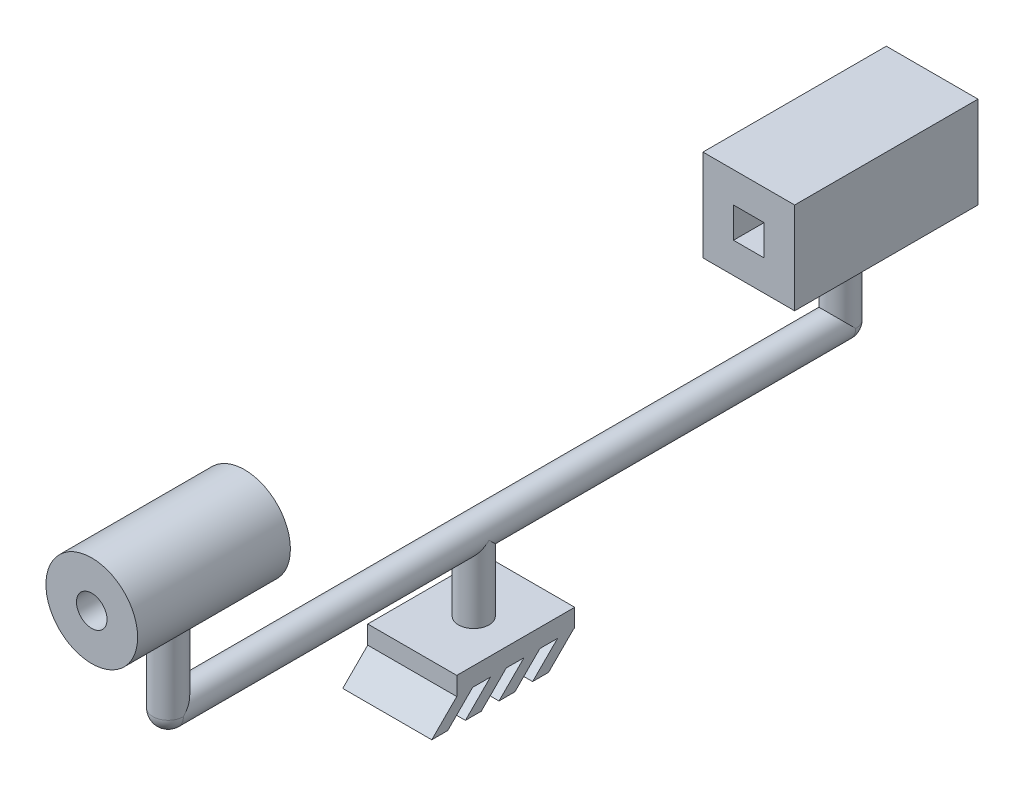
ISO-10303-21;
HEADER;
FILE_DESCRIPTION(('STEP AP214'),'2;1');
FILE_NAME('part.step','',(''),(''),'','','');
FILE_SCHEMA(('AUTOMOTIVE_DESIGN { 1 0 10303 214 1 1 1 1 }'));
ENDSEC;
DATA;
#1=APPLICATION_CONTEXT('core data for automotive mechanical design processes');
#2=APPLICATION_PROTOCOL_DEFINITION('international standard','automotive_design',2000,#1);
#3=PRODUCT_CONTEXT('',#1,'mechanical');
#4=PRODUCT('Part','Part','',(#3));
#5=PRODUCT_RELATED_PRODUCT_CATEGORY('part','',(#4));
#6=PRODUCT_DEFINITION_FORMATION('','',#4);
#7=PRODUCT_DEFINITION_CONTEXT('part definition',#1,'design');
#8=PRODUCT_DEFINITION('design','',#6,#7);
#9=PRODUCT_DEFINITION_SHAPE('','',#8);
#10=(LENGTH_UNIT() NAMED_UNIT(*) SI_UNIT(.MILLI.,.METRE.));
#11=(NAMED_UNIT(*) PLANE_ANGLE_UNIT() SI_UNIT($,.RADIAN.));
#12=(NAMED_UNIT(*) SI_UNIT($,.STERADIAN.) SOLID_ANGLE_UNIT());
#13=UNCERTAINTY_MEASURE_WITH_UNIT(LENGTH_MEASURE(1.E-05),#10,'distance_accuracy_value','');
#14=(GEOMETRIC_REPRESENTATION_CONTEXT(3) GLOBAL_UNCERTAINTY_ASSIGNED_CONTEXT((#13)) GLOBAL_UNIT_ASSIGNED_CONTEXT((#10,
#11,#12)) REPRESENTATION_CONTEXT('',''));
#15=CARTESIAN_POINT('',(0.,0.,0.));
#16=DIRECTION('',(0.,0.,1.));
#17=DIRECTION('',(1.,0.,0.));
#18=AXIS2_PLACEMENT_3D('',#15,#16,#17);
#19=CARTESIAN_POINT('',(7.01117221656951,-15.,-9.51015026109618));
#20=DIRECTION('',(0.,1.,0.));
#21=DIRECTION('',(0.,0.,1.));
#22=AXIS2_PLACEMENT_3D('',#19,#20,#21);
#23=PLANE('',#22);
#24=DIRECTION('',(0.,0.,1.));
#25=VECTOR('',#24,1.);
#26=CARTESIAN_POINT('',(7.01117221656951,-15.,9.7933368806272));
#27=LINE('',#26,#25);
#28=CARTESIAN_POINT('',(7.01117221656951,-15.,-9.51015026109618));
#29=VERTEX_POINT('',#28);
#30=CARTESIAN_POINT('',(7.01117221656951,-15.,-9.30861680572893));
#31=VERTEX_POINT('',#30);
#32=EDGE_CURVE('E59',#29,#31,#27,.T.);
#33=ORIENTED_EDGE('',*,*,#32,.T.);
#34=DIRECTION('',(1.,0.,0.));
#35=VECTOR('',#34,1.);
#36=CARTESIAN_POINT('',(-15.3955238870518,-15.,-9.30861680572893));
#37=LINE('',#36,#35);
#38=CARTESIAN_POINT('',(-7.5574973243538,-15.,-9.30861680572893));
#39=VERTEX_POINT('',#38);
#40=EDGE_CURVE('E264',#39,#31,#37,.T.);
#41=ORIENTED_EDGE('',*,*,#40,.F.);
#42=DIRECTION('',(0.,0.,-1.));
#43=VECTOR('',#42,1.);
#44=CARTESIAN_POINT('',(-7.5574973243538,-15.,9.7933368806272));
#45=LINE('',#44,#43);
#46=CARTESIAN_POINT('',(-7.5574973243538,-15.,-9.51015026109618));
#47=VERTEX_POINT('',#46);
#48=EDGE_CURVE('E365',#39,#47,#45,.T.);
#49=ORIENTED_EDGE('',*,*,#48,.T.);
#50=DIRECTION('',(1.,0.,0.));
#51=VECTOR('',#50,1.);
#52=CARTESIAN_POINT('',(7.01117221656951,-15.,-9.51015026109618));
#53=LINE('',#52,#51);
#54=EDGE_CURVE('E359',#47,#29,#53,.T.);
#55=ORIENTED_EDGE('',*,*,#54,.T.);
#56=EDGE_LOOP('',(#33,#41,#49,#55));
#57=FACE_BOUND('',#56,.T.);
#58=ADVANCED_FACE('F33',(#57),#23,.F.);
#59=CARTESIAN_POINT('',(-7.5574973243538,-15.,-3.80861680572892));
#60=VERTEX_POINT('',#59);
#61=CARTESIAN_POINT('',(-7.5574973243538,-15.,-6.7066631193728));
#62=VERTEX_POINT('',#61);
#63=EDGE_CURVE('E352',#60,#62,#45,.T.);
#64=ORIENTED_EDGE('',*,*,#63,.T.);
#65=DIRECTION('',(1.,0.,0.));
#66=VECTOR('',#65,1.);
#67=CARTESIAN_POINT('',(-15.3955238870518,-15.,-6.7066631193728));
#68=LINE('',#67,#66);
#69=CARTESIAN_POINT('',(7.01117221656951,-15.,-6.7066631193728));
#70=VERTEX_POINT('',#69);
#71=EDGE_CURVE('E51',#62,#70,#68,.T.);
#72=ORIENTED_EDGE('',*,*,#71,.T.);
#73=CARTESIAN_POINT('',(7.01117221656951,-15.,-3.80861680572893));
#74=VERTEX_POINT('',#73);
#75=EDGE_CURVE('E37',#70,#74,#27,.T.);
#76=ORIENTED_EDGE('',*,*,#75,.T.);
#77=DIRECTION('',(1.,0.,0.));
#78=VECTOR('',#77,1.);
#79=CARTESIAN_POINT('',(-15.3955238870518,-15.,-3.80861680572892));
#80=LINE('',#79,#78);
#81=EDGE_CURVE('E274',#60,#74,#80,.T.);
#82=ORIENTED_EDGE('',*,*,#81,.F.);
#83=EDGE_LOOP('',(#64,#72,#76,#82));
#84=FACE_BOUND('',#83,.T.);
#85=ADVANCED_FACE('F440',(#84),#23,.F.);
#86=CARTESIAN_POINT('',(-7.5574973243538,-15.,1.69138319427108));
#87=VERTEX_POINT('',#86);
#88=CARTESIAN_POINT('',(-7.5574973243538,-15.,-1.20666311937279));
#89=VERTEX_POINT('',#88);
#90=EDGE_CURVE('E350',#87,#89,#45,.T.);
#91=ORIENTED_EDGE('',*,*,#90,.T.);
#92=DIRECTION('',(1.,0.,0.));
#93=VECTOR('',#92,1.);
#94=CARTESIAN_POINT('',(-15.3955238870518,-15.,-1.2066631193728));
#95=LINE('',#94,#93);
#96=CARTESIAN_POINT('',(7.01117221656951,-15.,-1.20666311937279));
#97=VERTEX_POINT('',#96);
#98=EDGE_CURVE('E284',#89,#97,#95,.T.);
#99=ORIENTED_EDGE('',*,*,#98,.T.);
#100=CARTESIAN_POINT('',(7.01117221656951,-15.,1.69138319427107));
#101=VERTEX_POINT('',#100);
#102=EDGE_CURVE('E366',#97,#101,#27,.T.);
#103=ORIENTED_EDGE('',*,*,#102,.T.);
#104=DIRECTION('',(1.,0.,0.));
#105=VECTOR('',#104,1.);
#106=CARTESIAN_POINT('',(-15.3955238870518,-15.,1.69138319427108));
#107=LINE('',#106,#105);
#108=EDGE_CURVE('E298',#87,#101,#107,.T.);
#109=ORIENTED_EDGE('',*,*,#108,.F.);
#110=EDGE_LOOP('',(#91,#99,#103,#109));
#111=FACE_BOUND('',#110,.T.);
#112=ADVANCED_FACE('F446',(#111),#23,.F.);
#113=CARTESIAN_POINT('',(-7.5574973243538,-15.,7.19138319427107));
#114=VERTEX_POINT('',#113);
#115=CARTESIAN_POINT('',(-7.5574973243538,-15.,4.2933368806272));
#116=VERTEX_POINT('',#115);
#117=EDGE_CURVE('E338',#114,#116,#45,.T.);
#118=ORIENTED_EDGE('',*,*,#117,.T.);
#119=DIRECTION('',(1.,0.,0.));
#120=VECTOR('',#119,1.);
#121=CARTESIAN_POINT('',(-15.3955238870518,-15.,4.2933368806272));
#122=LINE('',#121,#120);
#123=CARTESIAN_POINT('',(7.01117221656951,-15.,4.2933368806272));
#124=VERTEX_POINT('',#123);
#125=EDGE_CURVE('E309',#116,#124,#122,.T.);
#126=ORIENTED_EDGE('',*,*,#125,.T.);
#127=CARTESIAN_POINT('',(7.01117221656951,-15.,7.19138319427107));
#128=VERTEX_POINT('',#127);
#129=EDGE_CURVE('E353',#124,#128,#27,.T.);
#130=ORIENTED_EDGE('',*,*,#129,.T.);
#131=DIRECTION('',(1.,0.,0.));
#132=VECTOR('',#131,1.);
#133=CARTESIAN_POINT('',(-15.3955238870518,-15.,7.19138319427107));
#134=LINE('',#133,#132);
#135=EDGE_CURVE('E323',#114,#128,#134,.T.);
#136=ORIENTED_EDGE('',*,*,#135,.F.);
#137=EDGE_LOOP('',(#118,#126,#130,#136));
#138=FACE_BOUND('',#137,.T.);
#139=ADVANCED_FACE('F442',(#138),#23,.F.);
#140=CARTESIAN_POINT('',(0.,20.,50.));
#141=DIRECTION('',(0.,-1.,0.));
#142=DIRECTION('',(0.,0.,-1.));
#143=AXIS2_PLACEMENT_3D('',#140,#141,#142);
#144=CYLINDRICAL_SURFACE('',#143,2.5);
#145=CARTESIAN_POINT('',(0.,0.,50.));
#146=DIRECTION('',(0.,1.,0.));
#147=DIRECTION('',(0.,0.,1.));
#148=AXIS2_PLACEMENT_3D('',#145,#146,#147);
#149=CIRCLE('',#148,2.5);
#150=CARTESIAN_POINT('',(-2.5,0.,50.));
#151=VERTEX_POINT('',#150);
#152=CARTESIAN_POINT('',(2.5,0.,50.));
#153=VERTEX_POINT('',#152);
#154=EDGE_CURVE('E559',#151,#153,#149,.T.);
#155=ORIENTED_EDGE('',*,*,#154,.T.);
#156=CARTESIAN_POINT('',(0.,0.,50.));
#157=DIRECTION('',(0.,-0.707106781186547,-0.707106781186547));
#158=DIRECTION('',(0.,0.707106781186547,-0.707106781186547));
#159=AXIS2_PLACEMENT_3D('',#156,#157,#158);
#160=ELLIPSE('',#159,3.53553390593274,2.5);
#161=EDGE_CURVE('E562',#153,#151,#160,.F.);
#162=ORIENTED_EDGE('',*,*,#161,.T.);
#163=EDGE_LOOP('',(#155,#162));
#164=FACE_BOUND('',#163,.T.);
#165=CARTESIAN_POINT('',(0.,12.5,47.5));
#166=CARTESIAN_POINT('',(-0.136408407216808,12.4999996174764,47.4999993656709));
#167=CARTESIAN_POINT('',(-0.272812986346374,12.5037557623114,47.5112006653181));
#168=CARTESIAN_POINT('',(-0.54160440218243,12.518369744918,47.555572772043));
#169=CARTESIAN_POINT('',(-0.673990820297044,12.5292283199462,47.5887458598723));
#170=CARTESIAN_POINT('',(-0.93083197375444,12.5568673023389,47.6757981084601));
#171=CARTESIAN_POINT('',(-1.05529956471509,12.5736378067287,47.7296426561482));
#172=CARTESIAN_POINT('',(-1.29343734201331,12.6113888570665,47.8563529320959));
#173=CARTESIAN_POINT('',(-1.40710539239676,12.6323702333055,47.9292224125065));
#174=CARTESIAN_POINT('',(-1.62435418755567,12.6771476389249,48.0945645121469));
#175=CARTESIAN_POINT('',(-1.72750925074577,12.7010110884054,48.1875780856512));
#176=CARTESIAN_POINT('',(-1.91708173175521,12.748492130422,48.3894178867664));
#177=CARTESIAN_POINT('',(-2.00349546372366,12.7721096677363,48.4982475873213));
#178=CARTESIAN_POINT('',(-2.15956235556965,12.8171666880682,48.7324627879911));
#179=CARTESIAN_POINT('',(-2.22866214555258,12.8385240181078,48.8582343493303));
#180=CARTESIAN_POINT('',(-2.3445471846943,12.875617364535,49.1204402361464));
#181=CARTESIAN_POINT('',(-2.39133924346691,12.8913550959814,49.2568712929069));
#182=CARTESIAN_POINT('',(-2.45968365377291,12.9147174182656,49.5316830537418));
#183=CARTESIAN_POINT('',(-2.48203362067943,12.9225976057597,49.6698430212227));
#184=CARTESIAN_POINT('',(-2.5033528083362,12.9301085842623,49.9481593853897));
#185=CARTESIAN_POINT('',(-2.5023292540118,12.9297419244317,50.088315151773));
#186=CARTESIAN_POINT('',(-2.47754975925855,12.9210246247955,50.3598415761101));
#187=CARTESIAN_POINT('',(-2.45483478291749,12.9130396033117,50.4913210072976));
#188=CARTESIAN_POINT('',(-2.38901540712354,12.8905835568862,50.7484835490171));
#189=CARTESIAN_POINT('',(-2.34590856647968,12.8761117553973,50.8741659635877));
#190=CARTESIAN_POINT('',(-2.23984764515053,12.8420522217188,51.1185318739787));
#191=CARTESIAN_POINT('',(-2.17658512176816,12.8223858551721,51.2370700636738));
#192=CARTESIAN_POINT('',(-2.03222276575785,12.7801860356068,51.4621772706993));
#193=CARTESIAN_POINT('',(-1.95111778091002,12.7576517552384,51.5687428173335));
#194=CARTESIAN_POINT('',(-1.7683733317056,12.7108167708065,51.7727289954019));
#195=CARTESIAN_POINT('',(-1.66588287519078,12.6864852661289,51.8693817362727));
#196=CARTESIAN_POINT('',(-1.44584892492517,12.6398265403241,52.0443281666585));
#197=CARTESIAN_POINT('',(-1.32830398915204,12.6174995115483,52.1226200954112));
#198=CARTESIAN_POINT('',(-1.07986903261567,12.5770723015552,52.2592407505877));
#199=CARTESIAN_POINT('',(-0.948858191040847,12.559016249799,52.3173637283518));
#200=CARTESIAN_POINT('',(-0.678172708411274,12.5294858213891,52.4105079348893));
#201=CARTESIAN_POINT('',(-0.538501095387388,12.518009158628,52.4455371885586));
#202=CARTESIAN_POINT('',(-0.260959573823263,12.503309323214,52.4901391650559));
#203=CARTESIAN_POINT('',(-0.123273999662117,12.4997499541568,52.5007495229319));
#204=CARTESIAN_POINT('',(0.151937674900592,12.5002774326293,52.4991683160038));
#205=CARTESIAN_POINT('',(0.289463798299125,12.5043629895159,52.4869806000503));
#206=CARTESIAN_POINT('',(0.556299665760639,12.5194993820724,52.4409702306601));
#207=CARTESIAN_POINT('',(0.685732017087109,12.5303450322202,52.4077844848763));
#208=CARTESIAN_POINT('',(0.937139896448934,12.5577038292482,52.3215163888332));
#209=CARTESIAN_POINT('',(1.05911447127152,12.5742176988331,52.2684315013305));
#210=CARTESIAN_POINT('',(1.29572074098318,12.6117767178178,52.142323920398));
#211=CARTESIAN_POINT('',(1.41007489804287,12.6329296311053,52.0688135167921));
#212=CARTESIAN_POINT('',(1.62516207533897,12.6773686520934,51.9045146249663));
#213=CARTESIAN_POINT('',(1.72589091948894,12.7006554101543,51.8137208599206));
#214=CARTESIAN_POINT('',(1.91563126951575,12.7480788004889,51.6125531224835));
#215=CARTESIAN_POINT('',(2.00390242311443,12.7722059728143,51.5014769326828));
#216=CARTESIAN_POINT('',(2.16064380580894,12.8175006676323,51.2655710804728));
#217=CARTESIAN_POINT('',(2.22911386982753,12.8386681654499,51.1407413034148));
#218=CARTESIAN_POINT('',(2.34399232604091,12.8754402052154,50.8808174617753));
#219=CARTESIAN_POINT('',(2.39044533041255,12.8910559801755,50.7457448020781));
#220=CARTESIAN_POINT('',(2.45973666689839,12.9147291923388,50.4690533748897));
#221=CARTESIAN_POINT('',(2.48258563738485,12.922790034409,50.3274375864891));
#222=CARTESIAN_POINT('',(2.50319070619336,12.9300535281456,50.0495072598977));
#223=CARTESIAN_POINT('',(2.502175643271,12.9296899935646,49.913294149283));
#224=CARTESIAN_POINT('',(2.47810573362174,12.9212182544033,49.6430873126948));
#225=CARTESIAN_POINT('',(2.45505219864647,12.913110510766,49.5090934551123));
#226=CARTESIAN_POINT('',(2.38842953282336,12.8903868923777,49.2496608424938));
#227=CARTESIAN_POINT('',(2.34525836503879,12.8758975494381,49.1241079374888));
#228=CARTESIAN_POINT('',(2.23994841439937,12.8420900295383,48.8819314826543));
#229=CARTESIAN_POINT('',(2.17780542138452,12.8227707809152,48.76530992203));
#230=CARTESIAN_POINT('',(2.03315173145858,12.7804292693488,48.5387908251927));
#231=CARTESIAN_POINT('',(1.94987060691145,12.7572822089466,48.429408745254));
#232=CARTESIAN_POINT('',(1.76660720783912,12.7104160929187,48.2257754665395));
#233=CARTESIAN_POINT('',(1.6666202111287,12.6866968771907,48.1315285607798));
#234=CARTESIAN_POINT('',(1.44810389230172,12.6402492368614,47.9571389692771));
#235=CARTESIAN_POINT('',(1.32900378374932,12.6175954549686,47.8776891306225));
#236=CARTESIAN_POINT('',(1.07839339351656,12.5768502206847,47.7400239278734));
#237=CARTESIAN_POINT('',(0.946886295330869,12.5587576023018,47.6818031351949));
#238=CARTESIAN_POINT('',(0.681234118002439,12.5298621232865,47.5906959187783));
#239=CARTESIAN_POINT('',(0.547469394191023,12.5187696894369,47.5567938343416));
#240=CARTESIAN_POINT('',(0.275801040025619,12.5038398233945,47.5114492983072));
#241=CARTESIAN_POINT('',(0.137898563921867,12.5000003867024,47.5000006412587));
#242=CARTESIAN_POINT('',(0.,12.5,47.5));
#243=B_SPLINE_CURVE_WITH_KNOTS('',3,(#165,#166,#167,#168,#169,#170,#171,#172,#173,#174,#175,
#176,#177,#178,#179,#180,#181,#182,#183,#184,#185,#186,#187,#188,#189,#190,#191,#192,#193,#194,
#195,#196,#197,#198,#199,#200,#201,#202,#203,#204,#205,#206,#207,#208,#209,#210,#211,#212,#213,
#214,#215,#216,#217,#218,#219,#220,#221,#222,#223,#224,#225,#226,#227,#228,#229,#230,#231,#232,
#233,#234,#235,#236,#237,#238,#239,#240,#241,#242),.UNSPECIFIED.,.T.,.F.,(4,2,2,2,2,2,2,2,2,2,2,
2,2,2,2,2,2,2,2,2,2,2,2,2,2,2,2,2,2,2,2,2,2,2,2,2,2,2,4),(0.,0.408717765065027,
0.817477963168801,1.22555668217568,1.63371594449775,2.0546171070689,2.47561083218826,
2.90870962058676,3.34167611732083,3.76004814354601,4.17829084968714,4.57742066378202,
4.97659827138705,5.38220427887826,5.78792756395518,6.21483264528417,6.64177864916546,
7.07296014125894,7.50399172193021,7.91633957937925,8.32861782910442,8.72895394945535,
9.1293411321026,9.54025999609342,9.95130452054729,10.3810255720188,10.8107502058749,
11.2396003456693,11.668257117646,12.0748916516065,12.4815019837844,12.8803896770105,
13.2793659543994,13.6957516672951,14.1122552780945,14.5449915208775,14.9776170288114,
15.3909139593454,15.8040966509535),.UNSPECIFIED.);
#244=CARTESIAN_POINT('',(0.,12.5,47.5));
#245=VERTEX_POINT('',#244);
#246=EDGE_CURVE('E381',#245,#245,#243,.T.);
#247=ORIENTED_EDGE('',*,*,#246,.F.);
#248=EDGE_LOOP('',(#247));
#249=FACE_BOUND('',#248,.T.);
#250=ADVANCED_FACE('F390',(#164,#249),#144,.T.);
#251=CARTESIAN_POINT('',(0.,20.,-60.));
#252=DIRECTION('',(0.,-1.,0.));
#253=DIRECTION('',(0.,0.,-1.));
#254=AXIS2_PLACEMENT_3D('',#251,#252,#253);
#255=CYLINDRICAL_SURFACE('',#254,2.5);
#256=CARTESIAN_POINT('',(0.,0.,-60.));
#257=DIRECTION('',(0.,1.,0.));
#258=DIRECTION('',(0.,0.,1.));
#259=AXIS2_PLACEMENT_3D('',#256,#257,#258);
#260=CIRCLE('',#259,2.5);
#261=CARTESIAN_POINT('',(2.5,0.,-60.));
#262=VERTEX_POINT('',#261);
#263=CARTESIAN_POINT('',(-2.5,0.,-60.));
#264=VERTEX_POINT('',#263);
#265=EDGE_CURVE('E565',#262,#264,#260,.T.);
#266=ORIENTED_EDGE('',*,*,#265,.T.);
#267=CARTESIAN_POINT('',(0.,0.,-60.));
#268=DIRECTION('',(0.,0.707106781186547,-0.707106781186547));
#269=DIRECTION('',(0.,-0.707106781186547,-0.707106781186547));
#270=AXIS2_PLACEMENT_3D('',#267,#268,#269);
#271=ELLIPSE('',#270,3.53553390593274,2.5);
#272=EDGE_CURVE('E568',#264,#262,#271,.T.);
#273=ORIENTED_EDGE('',*,*,#272,.T.);
#274=EDGE_LOOP('',(#266,#273));
#275=FACE_BOUND('',#274,.T.);
#276=CARTESIAN_POINT('',(0.,12.5,-60.));
#277=DIRECTION('',(0.,1.,0.));
#278=DIRECTION('',(0.,0.,1.));
#279=AXIS2_PLACEMENT_3D('',#276,#277,#278);
#280=CIRCLE('',#279,2.5);
#281=CARTESIAN_POINT('',(0.,12.5,-57.5));
#282=VERTEX_POINT('',#281);
#283=EDGE_CURVE('E388',#282,#282,#280,.T.);
#284=ORIENTED_EDGE('',*,*,#283,.F.);
#285=EDGE_LOOP('',(#284));
#286=FACE_BOUND('',#285,.T.);
#287=ADVANCED_FACE('F455',(#275,#286),#255,.T.);
#288=CARTESIAN_POINT('',(0.,0.,50.));
#289=DIRECTION('',(0.,0.,-1.));
#290=DIRECTION('',(-1.,0.,0.));
#291=AXIS2_PLACEMENT_3D('',#288,#289,#290);
#292=CYLINDRICAL_SURFACE('',#291,2.5);
#293=ORIENTED_EDGE('',*,*,#272,.F.);
#294=CARTESIAN_POINT('',(0.,0.,-60.));
#295=DIRECTION('',(0.,0.,1.));
#296=DIRECTION('',(1.,0.,0.));
#297=AXIS2_PLACEMENT_3D('',#294,#295,#296);
#298=CIRCLE('',#297,2.5);
#299=EDGE_CURVE('E571',#264,#262,#298,.T.);
#300=ORIENTED_EDGE('',*,*,#299,.T.);
#301=EDGE_LOOP('',(#293,#300));
#302=FACE_BOUND('',#301,.T.);
#303=CARTESIAN_POINT('',(0.,0.,0.));
#304=DIRECTION('',(0.,0.707106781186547,-0.707106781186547));
#305=DIRECTION('',(0.,0.707106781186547,0.707106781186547));
#306=AXIS2_PLACEMENT_3D('',#303,#304,#305);
#307=ELLIPSE('',#306,3.53553390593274,2.5);
#308=CARTESIAN_POINT('',(-2.5,0.,0.));
#309=VERTEX_POINT('',#308);
#310=CARTESIAN_POINT('',(2.5,0.,0.));
#311=VERTEX_POINT('',#310);
#312=EDGE_CURVE('E578',#309,#311,#307,.F.);
#313=ORIENTED_EDGE('',*,*,#312,.F.);
#314=CARTESIAN_POINT('',(0.,0.,0.));
#315=DIRECTION('',(0.,0.707106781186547,0.707106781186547));
#316=DIRECTION('',(0.,0.707106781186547,-0.707106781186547));
#317=AXIS2_PLACEMENT_3D('',#314,#315,#316);
#318=ELLIPSE('',#317,3.53553390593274,2.5);
#319=EDGE_CURVE('E576',#311,#309,#318,.F.);
#320=ORIENTED_EDGE('',*,*,#319,.F.);
#321=EDGE_LOOP('',(#313,#320));
#322=FACE_BOUND('',#321,.T.);
#323=ORIENTED_EDGE('',*,*,#161,.F.);
#324=CARTESIAN_POINT('',(0.,0.,50.));
#325=DIRECTION('',(0.,0.,1.));
#326=DIRECTION('',(1.,0.,0.));
#327=AXIS2_PLACEMENT_3D('',#324,#325,#326);
#328=CIRCLE('',#327,2.5);
#329=EDGE_CURVE('E574',#151,#153,#328,.T.);
#330=ORIENTED_EDGE('',*,*,#329,.F.);
#331=EDGE_LOOP('',(#323,#330));
#332=FACE_BOUND('',#331,.T.);
#333=ADVANCED_FACE('F435',(#302,#322,#332),#292,.T.);
#334=CARTESIAN_POINT('',(0.,-12.,0.));
#335=DIRECTION('',(0.,1.,0.));
#336=DIRECTION('',(0.,0.,1.));
#337=AXIS2_PLACEMENT_3D('',#334,#335,#336);
#338=CYLINDRICAL_SURFACE('',#337,2.5);
#339=CARTESIAN_POINT('',(0.,-12.,0.));
#340=DIRECTION('',(0.,1.,0.));
#341=DIRECTION('',(0.,0.,1.));
#342=AXIS2_PLACEMENT_3D('',#339,#340,#341);
#343=CIRCLE('',#342,2.5);
#344=CARTESIAN_POINT('',(0.,-12.,2.5));
#345=VERTEX_POINT('',#344);
#346=EDGE_CURVE('E495',#345,#345,#343,.F.);
#347=ORIENTED_EDGE('',*,*,#346,.F.);
#348=EDGE_LOOP('',(#347));
#349=FACE_BOUND('',#348,.T.);
#350=ORIENTED_EDGE('',*,*,#319,.T.);
#351=ORIENTED_EDGE('',*,*,#312,.T.);
#352=EDGE_LOOP('',(#350,#351));
#353=FACE_BOUND('',#352,.T.);
#354=ADVANCED_FACE('F35',(#349,#353),#338,.T.);
#355=CARTESIAN_POINT('',(7.5,27.5,-45.));
#356=DIRECTION('',(0.,0.,-1.));
#357=DIRECTION('',(-1.,0.,0.));
#358=AXIS2_PLACEMENT_3D('',#355,#356,#357);
#359=PLANE('',#358);
#360=DIRECTION('',(-1.,0.,0.));
#361=VECTOR('',#360,1.);
#362=CARTESIAN_POINT('',(2.5,22.5,-45.));
#363=LINE('',#362,#361);
#364=CARTESIAN_POINT('',(2.5,22.5,-45.));
#365=VERTEX_POINT('',#364);
#366=CARTESIAN_POINT('',(-2.5,22.5,-45.));
#367=VERTEX_POINT('',#366);
#368=EDGE_CURVE('E500',#365,#367,#363,.T.);
#369=ORIENTED_EDGE('',*,*,#368,.F.);
#370=DIRECTION('',(0.,1.,0.));
#371=VECTOR('',#370,1.);
#372=CARTESIAN_POINT('',(2.5,22.5,-45.));
#373=LINE('',#372,#371);
#374=CARTESIAN_POINT('',(2.5,17.5,-45.));
#375=VERTEX_POINT('',#374);
#376=EDGE_CURVE('E498',#375,#365,#373,.T.);
#377=ORIENTED_EDGE('',*,*,#376,.F.);
#378=DIRECTION('',(1.,0.,0.));
#379=VECTOR('',#378,1.);
#380=CARTESIAN_POINT('',(2.5,17.5,-45.));
#381=LINE('',#380,#379);
#382=CARTESIAN_POINT('',(-2.5,17.5,-45.));
#383=VERTEX_POINT('',#382);
#384=EDGE_CURVE('E506',#383,#375,#381,.T.);
#385=ORIENTED_EDGE('',*,*,#384,.F.);
#386=DIRECTION('',(0.,-1.,0.));
#387=VECTOR('',#386,1.);
#388=CARTESIAN_POINT('',(-2.5,22.5,-45.));
#389=LINE('',#388,#387);
#390=EDGE_CURVE('E503',#367,#383,#389,.T.);
#391=ORIENTED_EDGE('',*,*,#390,.F.);
#392=EDGE_LOOP('',(#369,#377,#385,#391));
#393=FACE_BOUND('',#392,.T.);
#394=DIRECTION('',(-1.,0.,0.));
#395=VECTOR('',#394,1.);
#396=CARTESIAN_POINT('',(7.5,27.5,-45.));
#397=LINE('',#396,#395);
#398=CARTESIAN_POINT('',(7.5,27.5,-45.));
#399=VERTEX_POINT('',#398);
#400=CARTESIAN_POINT('',(-7.5,27.5,-45.));
#401=VERTEX_POINT('',#400);
#402=EDGE_CURVE('E551',#399,#401,#397,.T.);
#403=ORIENTED_EDGE('',*,*,#402,.T.);
#404=DIRECTION('',(0.,-1.,0.));
#405=VECTOR('',#404,1.);
#406=CARTESIAN_POINT('',(-7.5,27.5,-45.));
#407=LINE('',#406,#405);
#408=CARTESIAN_POINT('',(-7.5,12.5,-45.));
#409=VERTEX_POINT('',#408);
#410=EDGE_CURVE('E530',#401,#409,#407,.T.);
#411=ORIENTED_EDGE('',*,*,#410,.T.);
#412=DIRECTION('',(-1.,0.,0.));
#413=VECTOR('',#412,1.);
#414=CARTESIAN_POINT('',(7.5,12.5,-45.));
#415=LINE('',#414,#413);
#416=CARTESIAN_POINT('',(7.5,12.5,-45.));
#417=VERTEX_POINT('',#416);
#418=EDGE_CURVE('E557',#417,#409,#415,.T.);
#419=ORIENTED_EDGE('',*,*,#418,.F.);
#420=DIRECTION('',(0.,-1.,0.));
#421=VECTOR('',#420,1.);
#422=CARTESIAN_POINT('',(7.5,27.5,-45.));
#423=LINE('',#422,#421);
#424=EDGE_CURVE('E542',#399,#417,#423,.T.);
#425=ORIENTED_EDGE('',*,*,#424,.F.);
#426=EDGE_LOOP('',(#403,#411,#419,#425));
#427=FACE_BOUND('',#426,.T.);
#428=ADVANCED_FACE('F428',(#393,#427),#359,.F.);
#429=CARTESIAN_POINT('',(7.5,12.5,-45.));
#430=DIRECTION('',(0.,1.,0.));
#431=DIRECTION('',(0.,0.,1.));
#432=AXIS2_PLACEMENT_3D('',#429,#430,#431);
#433=PLANE('',#432);
#434=ORIENTED_EDGE('',*,*,#283,.T.);
#435=EDGE_LOOP('',(#434));
#436=FACE_BOUND('',#435,.T.);
#437=ORIENTED_EDGE('',*,*,#418,.T.);
#438=DIRECTION('',(0.,0.,-1.));
#439=VECTOR('',#438,1.);
#440=CARTESIAN_POINT('',(-7.5,12.5,-45.));
#441=LINE('',#440,#439);
#442=CARTESIAN_POINT('',(-7.5,12.5,-75.));
#443=VERTEX_POINT('',#442);
#444=EDGE_CURVE('E533',#409,#443,#441,.T.);
#445=ORIENTED_EDGE('',*,*,#444,.T.);
#446=DIRECTION('',(-1.,0.,0.));
#447=VECTOR('',#446,1.);
#448=CARTESIAN_POINT('',(7.5,12.5,-75.));
#449=LINE('',#448,#447);
#450=CARTESIAN_POINT('',(7.5,12.5,-75.));
#451=VERTEX_POINT('',#450);
#452=EDGE_CURVE('E555',#451,#443,#449,.T.);
#453=ORIENTED_EDGE('',*,*,#452,.F.);
#454=DIRECTION('',(0.,0.,-1.));
#455=VECTOR('',#454,1.);
#456=CARTESIAN_POINT('',(7.5,12.5,-45.));
#457=LINE('',#456,#455);
#458=EDGE_CURVE('E545',#417,#451,#457,.T.);
#459=ORIENTED_EDGE('',*,*,#458,.F.);
#460=EDGE_LOOP('',(#437,#445,#453,#459));
#461=FACE_BOUND('',#460,.T.);
#462=ADVANCED_FACE('F425',(#436,#461),#433,.F.);
#463=CARTESIAN_POINT('',(7.5,27.5,-75.));
#464=DIRECTION('',(0.,0.,1.));
#465=DIRECTION('',(0.,-1.,0.));
#466=AXIS2_PLACEMENT_3D('',#463,#464,#465);
#467=PLANE('',#466);
#468=DIRECTION('',(1.,0.,0.));
#469=VECTOR('',#468,1.);
#470=CARTESIAN_POINT('',(7.5,17.5,-75.));
#471=LINE('',#470,#469);
#472=CARTESIAN_POINT('',(-2.5,17.5,-75.));
#473=VERTEX_POINT('',#472);
#474=CARTESIAN_POINT('',(2.5,17.5,-75.));
#475=VERTEX_POINT('',#474);
#476=EDGE_CURVE('E43',#473,#475,#471,.T.);
#477=ORIENTED_EDGE('',*,*,#476,.T.);
#478=DIRECTION('',(0.,1.,0.));
#479=VECTOR('',#478,1.);
#480=CARTESIAN_POINT('',(2.5,27.5,-75.));
#481=LINE('',#480,#479);
#482=CARTESIAN_POINT('',(2.5,22.5,-75.));
#483=VERTEX_POINT('',#482);
#484=EDGE_CURVE('E11',#475,#483,#481,.T.);
#485=ORIENTED_EDGE('',*,*,#484,.T.);
#486=DIRECTION('',(-1.,0.,0.));
#487=VECTOR('',#486,1.);
#488=CARTESIAN_POINT('',(7.5,22.5,-75.));
#489=LINE('',#488,#487);
#490=CARTESIAN_POINT('',(-2.5,22.5,-75.));
#491=VERTEX_POINT('',#490);
#492=EDGE_CURVE('E378',#483,#491,#489,.T.);
#493=ORIENTED_EDGE('',*,*,#492,.T.);
#494=DIRECTION('',(0.,-1.,0.));
#495=VECTOR('',#494,1.);
#496=CARTESIAN_POINT('',(-2.5,27.5,-75.));
#497=LINE('',#496,#495);
#498=EDGE_CURVE('E375',#491,#473,#497,.T.);
#499=ORIENTED_EDGE('',*,*,#498,.T.);
#500=EDGE_LOOP('',(#477,#485,#493,#499));
#501=FACE_BOUND('',#500,.T.);
#502=ORIENTED_EDGE('',*,*,#452,.T.);
#503=DIRECTION('',(0.,1.,0.));
#504=VECTOR('',#503,1.);
#505=CARTESIAN_POINT('',(-7.5,27.5,-75.));
#506=LINE('',#505,#504);
#507=CARTESIAN_POINT('',(-7.5,27.5,-75.));
#508=VERTEX_POINT('',#507);
#509=EDGE_CURVE('E536',#443,#508,#506,.T.);
#510=ORIENTED_EDGE('',*,*,#509,.T.);
#511=DIRECTION('',(-1.,0.,0.));
#512=VECTOR('',#511,1.);
#513=CARTESIAN_POINT('',(7.5,27.5,-75.));
#514=LINE('',#513,#512);
#515=CARTESIAN_POINT('',(7.5,27.5,-75.));
#516=VERTEX_POINT('',#515);
#517=EDGE_CURVE('E553',#516,#508,#514,.T.);
#518=ORIENTED_EDGE('',*,*,#517,.F.);
#519=DIRECTION('',(0.,1.,0.));
#520=VECTOR('',#519,1.);
#521=CARTESIAN_POINT('',(7.5,27.5,-75.));
#522=LINE('',#521,#520);
#523=EDGE_CURVE('E547',#451,#516,#522,.T.);
#524=ORIENTED_EDGE('',*,*,#523,.F.);
#525=EDGE_LOOP('',(#502,#510,#518,#524));
#526=FACE_BOUND('',#525,.T.);
#527=ADVANCED_FACE('F421',(#501,#526),#467,.F.);
#528=CARTESIAN_POINT('',(7.5,27.5,-45.));
#529=DIRECTION('',(0.,-1.,0.));
#530=DIRECTION('',(0.,0.,-1.));
#531=AXIS2_PLACEMENT_3D('',#528,#529,#530);
#532=PLANE('',#531);
#533=ORIENTED_EDGE('',*,*,#517,.T.);
#534=DIRECTION('',(0.,0.,1.));
#535=VECTOR('',#534,1.);
#536=CARTESIAN_POINT('',(-7.5,27.5,-45.));
#537=LINE('',#536,#535);
#538=EDGE_CURVE('E539',#508,#401,#537,.T.);
#539=ORIENTED_EDGE('',*,*,#538,.T.);
#540=ORIENTED_EDGE('',*,*,#402,.F.);
#541=DIRECTION('',(0.,0.,1.));
#542=VECTOR('',#541,1.);
#543=CARTESIAN_POINT('',(7.5,27.5,-45.));
#544=LINE('',#543,#542);
#545=EDGE_CURVE('E549',#516,#399,#544,.T.);
#546=ORIENTED_EDGE('',*,*,#545,.F.);
#547=EDGE_LOOP('',(#533,#539,#540,#546));
#548=FACE_BOUND('',#547,.T.);
#549=ADVANCED_FACE('F417',(#548),#532,.F.);
#550=CARTESIAN_POINT('',(7.5,12.5,-45.));
#551=DIRECTION('',(1.,0.,0.));
#552=DIRECTION('',(0.,0.,-1.));
#553=AXIS2_PLACEMENT_3D('',#550,#551,#552);
#554=PLANE('',#553);
#555=ORIENTED_EDGE('',*,*,#424,.T.);
#556=ORIENTED_EDGE('',*,*,#458,.T.);
#557=ORIENTED_EDGE('',*,*,#523,.T.);
#558=ORIENTED_EDGE('',*,*,#545,.T.);
#559=EDGE_LOOP('',(#555,#556,#557,#558));
#560=FACE_BOUND('',#559,.T.);
#561=ADVANCED_FACE('F413',(#560),#554,.T.);
#562=CARTESIAN_POINT('',(-7.5,12.5,-45.));
#563=DIRECTION('',(1.,0.,0.));
#564=DIRECTION('',(0.,0.,-1.));
#565=AXIS2_PLACEMENT_3D('',#562,#563,#564);
#566=PLANE('',#565);
#567=ORIENTED_EDGE('',*,*,#410,.F.);
#568=ORIENTED_EDGE('',*,*,#538,.F.);
#569=ORIENTED_EDGE('',*,*,#509,.F.);
#570=ORIENTED_EDGE('',*,*,#444,.F.);
#571=EDGE_LOOP('',(#567,#568,#569,#570));
#572=FACE_BOUND('',#571,.T.);
#573=ADVANCED_FACE('F400',(#572),#566,.F.);
#574=CARTESIAN_POINT('',(0.,20.,49.2113935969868));
#575=DIRECTION('',(0.,0.,1.));
#576=DIRECTION('',(1.,0.,0.));
#577=AXIS2_PLACEMENT_3D('',#574,#575,#576);
#578=CYLINDRICAL_SURFACE('',#577,7.5);
#579=CARTESIAN_POINT('',(0.,20.,37.5));
#580=DIRECTION('',(0.,0.,1.));
#581=DIRECTION('',(1.,0.,0.));
#582=AXIS2_PLACEMENT_3D('',#579,#580,#581);
#583=CIRCLE('',#582,7.5);
#584=CARTESIAN_POINT('',(7.5,20.,37.5));
#585=VERTEX_POINT('',#584);
#586=EDGE_CURVE('E527',#585,#585,#583,.T.);
#587=ORIENTED_EDGE('',*,*,#586,.T.);
#588=EDGE_LOOP('',(#587));
#589=FACE_BOUND('',#588,.T.);
#590=CARTESIAN_POINT('',(0.,20.,62.5));
#591=DIRECTION('',(0.,0.,1.));
#592=DIRECTION('',(1.,0.,0.));
#593=AXIS2_PLACEMENT_3D('',#590,#591,#592);
#594=CIRCLE('',#593,7.5);
#595=CARTESIAN_POINT('',(7.5,20.,62.5));
#596=VERTEX_POINT('',#595);
#597=EDGE_CURVE('E524',#596,#596,#594,.T.);
#598=ORIENTED_EDGE('',*,*,#597,.F.);
#599=EDGE_LOOP('',(#598));
#600=FACE_BOUND('',#599,.T.);
#601=ORIENTED_EDGE('',*,*,#246,.T.);
#602=EDGE_LOOP('',(#601));
#603=FACE_BOUND('',#602,.T.);
#604=ADVANCED_FACE('F394',(#589,#600,#603),#578,.T.);
#605=CARTESIAN_POINT('',(0.,27.5,62.5));
#606=DIRECTION('',(0.,0.,-1.));
#607=DIRECTION('',(-1.,0.,0.));
#608=AXIS2_PLACEMENT_3D('',#605,#606,#607);
#609=PLANE('',#608);
#610=CARTESIAN_POINT('',(0.,20.,62.5));
#611=DIRECTION('',(0.,0.,1.));
#612=DIRECTION('',(1.,0.,0.));
#613=AXIS2_PLACEMENT_3D('',#610,#611,#612);
#614=CIRCLE('',#613,2.5);
#615=CARTESIAN_POINT('',(2.5,20.,62.5));
#616=VERTEX_POINT('',#615);
#617=EDGE_CURVE('E521',#616,#616,#614,.T.);
#618=ORIENTED_EDGE('',*,*,#617,.F.);
#619=EDGE_LOOP('',(#618));
#620=FACE_BOUND('',#619,.T.);
#621=ORIENTED_EDGE('',*,*,#597,.T.);
#622=EDGE_LOOP('',(#621));
#623=FACE_BOUND('',#622,.T.);
#624=ADVANCED_FACE('F399',(#620,#623),#609,.F.);
#625=CARTESIAN_POINT('',(0.,27.5,37.5));
#626=DIRECTION('',(0.,0.,1.));
#627=DIRECTION('',(1.,0.,0.));
#628=AXIS2_PLACEMENT_3D('',#625,#626,#627);
#629=PLANE('',#628);
#630=CARTESIAN_POINT('',(0.,20.,37.5));
#631=DIRECTION('',(0.,0.,1.));
#632=DIRECTION('',(1.,0.,0.));
#633=AXIS2_PLACEMENT_3D('',#630,#631,#632);
#634=CIRCLE('',#633,2.5);
#635=CARTESIAN_POINT('',(2.5,20.,37.5));
#636=VERTEX_POINT('',#635);
#637=EDGE_CURVE('E512',#636,#636,#634,.F.);
#638=ORIENTED_EDGE('',*,*,#637,.F.);
#639=EDGE_LOOP('',(#638));
#640=FACE_BOUND('',#639,.T.);
#641=ORIENTED_EDGE('',*,*,#586,.F.);
#642=EDGE_LOOP('',(#641));
#643=FACE_BOUND('',#642,.T.);
#644=ADVANCED_FACE('F404',(#640,#643),#629,.F.);
#645=CARTESIAN_POINT('',(0.,20.,-75.001));
#646=DIRECTION('',(0.,0.,1.));
#647=DIRECTION('',(1.,0.,0.));
#648=AXIS2_PLACEMENT_3D('',#645,#646,#647);
#649=CYLINDRICAL_SURFACE('',#648,2.5);
#650=ORIENTED_EDGE('',*,*,#617,.T.);
#651=EDGE_LOOP('',(#650));
#652=FACE_BOUND('',#651,.T.);
#653=ORIENTED_EDGE('',*,*,#637,.T.);
#654=EDGE_LOOP('',(#653));
#655=FACE_BOUND('',#654,.T.);
#656=ADVANCED_FACE('F402',(#652,#655),#649,.F.);
#657=CARTESIAN_POINT('',(2.5,22.5,-97.5));
#658=DIRECTION('',(1.,0.,0.));
#659=DIRECTION('',(0.,1.,0.));
#660=AXIS2_PLACEMENT_3D('',#657,#658,#659);
#661=PLANE('',#660);
#662=DIRECTION('',(0.,0.,1.));
#663=VECTOR('',#662,1.);
#664=CARTESIAN_POINT('',(2.5,17.5,-97.5));
#665=LINE('',#664,#663);
#666=EDGE_CURVE('E510',#475,#375,#665,.T.);
#667=ORIENTED_EDGE('',*,*,#666,.T.);
#668=ORIENTED_EDGE('',*,*,#376,.T.);
#669=DIRECTION('',(0.,0.,1.));
#670=VECTOR('',#669,1.);
#671=CARTESIAN_POINT('',(2.5,22.5,-97.5));
#672=LINE('',#671,#670);
#673=EDGE_CURVE('E509',#483,#365,#672,.T.);
#674=ORIENTED_EDGE('',*,*,#673,.F.);
#675=ORIENTED_EDGE('',*,*,#484,.F.);
#676=EDGE_LOOP('',(#667,#668,#674,#675));
#677=FACE_BOUND('',#676,.T.);
#678=ADVANCED_FACE('F702',(#677),#661,.F.);
#679=CARTESIAN_POINT('',(2.5,17.5,-97.5));
#680=DIRECTION('',(0.,-1.,0.));
#681=DIRECTION('',(0.,0.,-1.));
#682=AXIS2_PLACEMENT_3D('',#679,#680,#681);
#683=PLANE('',#682);
#684=DIRECTION('',(0.,0.,1.));
#685=VECTOR('',#684,1.);
#686=CARTESIAN_POINT('',(-2.5,17.5,-97.5));
#687=LINE('',#686,#685);
#688=EDGE_CURVE('E513',#473,#383,#687,.T.);
#689=ORIENTED_EDGE('',*,*,#688,.T.);
#690=ORIENTED_EDGE('',*,*,#384,.T.);
#691=ORIENTED_EDGE('',*,*,#666,.F.);
#692=ORIENTED_EDGE('',*,*,#476,.F.);
#693=EDGE_LOOP('',(#689,#690,#691,#692));
#694=FACE_BOUND('',#693,.T.);
#695=ADVANCED_FACE('F698',(#694),#683,.F.);
#696=CARTESIAN_POINT('',(-2.5,22.5,-97.5));
#697=DIRECTION('',(-1.,0.,0.));
#698=DIRECTION('',(0.,-1.,0.));
#699=AXIS2_PLACEMENT_3D('',#696,#697,#698);
#700=PLANE('',#699);
#701=DIRECTION('',(0.,0.,1.));
#702=VECTOR('',#701,1.);
#703=CARTESIAN_POINT('',(-2.5,22.5,-97.5));
#704=LINE('',#703,#702);
#705=EDGE_CURVE('E515',#491,#367,#704,.T.);
#706=ORIENTED_EDGE('',*,*,#705,.T.);
#707=ORIENTED_EDGE('',*,*,#390,.T.);
#708=ORIENTED_EDGE('',*,*,#688,.F.);
#709=ORIENTED_EDGE('',*,*,#498,.F.);
#710=EDGE_LOOP('',(#706,#707,#708,#709));
#711=FACE_BOUND('',#710,.T.);
#712=ADVANCED_FACE('F701',(#711),#700,.F.);
#713=CARTESIAN_POINT('',(2.5,22.5,-97.5));
#714=DIRECTION('',(0.,1.,0.));
#715=DIRECTION('',(0.,0.,1.));
#716=AXIS2_PLACEMENT_3D('',#713,#714,#715);
#717=PLANE('',#716);
#718=ORIENTED_EDGE('',*,*,#673,.T.);
#719=ORIENTED_EDGE('',*,*,#368,.T.);
#720=ORIENTED_EDGE('',*,*,#705,.F.);
#721=ORIENTED_EDGE('',*,*,#492,.F.);
#722=EDGE_LOOP('',(#718,#719,#720,#721));
#723=FACE_BOUND('',#722,.T.);
#724=ADVANCED_FACE('F697',(#723),#717,.F.);
#725=CARTESIAN_POINT('',(7.01117221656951,-15.,9.7933368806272));
#726=DIRECTION('',(-1.,0.,0.));
#727=DIRECTION('',(0.,0.,1.));
#728=AXIS2_PLACEMENT_3D('',#725,#726,#727);
#729=PLANE('',#728);
#730=DIRECTION('',(0.,0.,1.));
#731=VECTOR('',#730,1.);
#732=CARTESIAN_POINT('',(7.01117221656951,-12.,9.7933368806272));
#733=LINE('',#732,#731);
#734=CARTESIAN_POINT('',(7.01117221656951,-12.,-9.51015026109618));
#735=VERTEX_POINT('',#734);
#736=CARTESIAN_POINT('',(7.01117221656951,-12.,9.7933368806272));
#737=VERTEX_POINT('',#736);
#738=EDGE_CURVE('E679',#735,#737,#733,.T.);
#739=ORIENTED_EDGE('',*,*,#738,.T.);
#740=DIRECTION('',(0.,1.,0.));
#741=VECTOR('',#740,1.);
#742=CARTESIAN_POINT('',(7.01117221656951,-15.,9.7933368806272));
#743=LINE('',#742,#741);
#744=CARTESIAN_POINT('',(7.01117221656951,-15.,9.7933368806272));
#745=VERTEX_POINT('',#744);
#746=EDGE_CURVE('E492',#745,#737,#743,.T.);
#747=ORIENTED_EDGE('',*,*,#746,.F.);
#748=DIRECTION('',(0.,-0.707106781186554,0.707106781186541));
#749=VECTOR('',#748,1.);
#750=CARTESIAN_POINT('',(7.01117221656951,-15.,9.7933368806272));
#751=LINE('',#750,#749);
#752=CARTESIAN_POINT('',(7.01117221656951,-19.086489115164,13.8798259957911));
#753=VERTEX_POINT('',#752);
#754=EDGE_CURVE('E319',#745,#753,#751,.T.);
#755=ORIENTED_EDGE('',*,*,#754,.T.);
#756=DIRECTION('',(0.,0.,-1.));
#757=VECTOR('',#756,1.);
#758=CARTESIAN_POINT('',(7.01117221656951,-19.086489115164,13.8798259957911));
#759=LINE('',#758,#757);
#760=CARTESIAN_POINT('',(7.01117221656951,-19.086489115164,11.277872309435));
#761=VERTEX_POINT('',#760);
#762=EDGE_CURVE('E326',#753,#761,#759,.T.);
#763=ORIENTED_EDGE('',*,*,#762,.T.);
#764=DIRECTION('',(0.,0.707106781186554,-0.707106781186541));
#765=VECTOR('',#764,1.);
#766=CARTESIAN_POINT('',(7.01117221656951,-19.086489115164,11.277872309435));
#767=LINE('',#766,#765);
#768=EDGE_CURVE('E329',#761,#128,#767,.T.);
#769=ORIENTED_EDGE('',*,*,#768,.T.);
#770=ORIENTED_EDGE('',*,*,#129,.F.);
#771=DIRECTION('',(0.,-0.707106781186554,0.707106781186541));
#772=VECTOR('',#771,1.);
#773=CARTESIAN_POINT('',(7.01117221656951,-15.,4.2933368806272));
#774=LINE('',#773,#772);
#775=CARTESIAN_POINT('',(7.01117221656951,-19.086489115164,8.37982599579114));
#776=VERTEX_POINT('',#775);
#777=EDGE_CURVE('E294',#124,#776,#774,.T.);
#778=ORIENTED_EDGE('',*,*,#777,.T.);
#779=DIRECTION('',(0.,0.,-1.));
#780=VECTOR('',#779,1.);
#781=CARTESIAN_POINT('',(7.01117221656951,-19.086489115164,8.37982599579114));
#782=LINE('',#781,#780);
#783=CARTESIAN_POINT('',(7.01117221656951,-19.086489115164,5.77787230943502));
#784=VERTEX_POINT('',#783);
#785=EDGE_CURVE('E303',#776,#784,#782,.T.);
#786=ORIENTED_EDGE('',*,*,#785,.T.);
#787=DIRECTION('',(0.,0.707106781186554,-0.707106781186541));
#788=VECTOR('',#787,1.);
#789=CARTESIAN_POINT('',(7.01117221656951,-19.086489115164,5.77787230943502));
#790=LINE('',#789,#788);
#791=EDGE_CURVE('E306',#784,#101,#790,.T.);
#792=ORIENTED_EDGE('',*,*,#791,.T.);
#793=ORIENTED_EDGE('',*,*,#102,.F.);
#794=DIRECTION('',(0.,-0.707106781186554,0.707106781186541));
#795=VECTOR('',#794,1.);
#796=CARTESIAN_POINT('',(7.01117221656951,-15.,-1.2066631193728));
#797=LINE('',#796,#795);
#798=CARTESIAN_POINT('',(7.01117221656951,-19.086489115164,2.87982599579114));
#799=VERTEX_POINT('',#798);
#800=EDGE_CURVE('E270',#97,#799,#797,.T.);
#801=ORIENTED_EDGE('',*,*,#800,.T.);
#802=DIRECTION('',(0.,0.,-1.));
#803=VECTOR('',#802,1.);
#804=CARTESIAN_POINT('',(7.01117221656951,-19.086489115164,2.87982599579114));
#805=LINE('',#804,#803);
#806=CARTESIAN_POINT('',(7.01117221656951,-19.086489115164,0.277872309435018));
#807=VERTEX_POINT('',#806);
#808=EDGE_CURVE('E279',#799,#807,#805,.T.);
#809=ORIENTED_EDGE('',*,*,#808,.T.);
#810=DIRECTION('',(0.,0.707106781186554,-0.707106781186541));
#811=VECTOR('',#810,1.);
#812=CARTESIAN_POINT('',(7.01117221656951,-19.086489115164,0.277872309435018));
#813=LINE('',#812,#811);
#814=EDGE_CURVE('E282',#807,#74,#813,.T.);
#815=ORIENTED_EDGE('',*,*,#814,.T.);
#816=ORIENTED_EDGE('',*,*,#75,.F.);
#817=DIRECTION('',(0.,-0.707106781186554,0.707106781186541));
#818=VECTOR('',#817,1.);
#819=CARTESIAN_POINT('',(7.01117221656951,-15.,-6.7066631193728));
#820=LINE('',#819,#818);
#821=CARTESIAN_POINT('',(7.01117221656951,-19.086489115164,-2.62017400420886));
#822=VERTEX_POINT('',#821);
#823=EDGE_CURVE('E239',#70,#822,#820,.T.);
#824=ORIENTED_EDGE('',*,*,#823,.T.);
#825=DIRECTION('',(0.,0.,-1.));
#826=VECTOR('',#825,1.);
#827=CARTESIAN_POINT('',(7.01117221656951,-19.086489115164,-2.62017400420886));
#828=LINE('',#827,#826);
#829=CARTESIAN_POINT('',(7.01117221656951,-19.086489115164,-5.22212769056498));
#830=VERTEX_POINT('',#829);
#831=EDGE_CURVE('E247',#822,#830,#828,.T.);
#832=ORIENTED_EDGE('',*,*,#831,.T.);
#833=DIRECTION('',(0.,0.707106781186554,-0.707106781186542));
#834=VECTOR('',#833,1.);
#835=CARTESIAN_POINT('',(7.01117221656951,-19.086489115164,-5.22212769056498));
#836=LINE('',#835,#834);
#837=EDGE_CURVE('E253',#830,#31,#836,.T.);
#838=ORIENTED_EDGE('',*,*,#837,.T.);
#839=ORIENTED_EDGE('',*,*,#32,.F.);
#840=DIRECTION('',(0.,1.,0.));
#841=VECTOR('',#840,1.);
#842=CARTESIAN_POINT('',(7.01117221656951,-15.,-9.51015026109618));
#843=LINE('',#842,#841);
#844=EDGE_CURVE('E485',#29,#735,#843,.T.);
#845=ORIENTED_EDGE('',*,*,#844,.T.);
#846=EDGE_LOOP('',(#739,#747,#755,#763,#769,#770,#778,#786,#792,#793,#801,#809,#815,#816,#824,
#832,#838,#839,#845));
#847=FACE_BOUND('',#846,.T.);
#848=ADVANCED_FACE('F256',(#847),#729,.F.);
#849=CARTESIAN_POINT('',(7.01117221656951,-15.,9.7933368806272));
#850=DIRECTION('',(0.,0.,-1.));
#851=DIRECTION('',(-1.,0.,0.));
#852=AXIS2_PLACEMENT_3D('',#849,#850,#851);
#853=PLANE('',#852);
#854=DIRECTION('',(-1.,0.,0.));
#855=VECTOR('',#854,1.);
#856=CARTESIAN_POINT('',(7.01117221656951,-12.,9.7933368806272));
#857=LINE('',#856,#855);
#858=CARTESIAN_POINT('',(-7.5574973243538,-12.,9.7933368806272));
#859=VERTEX_POINT('',#858);
#860=EDGE_CURVE('E481',#737,#859,#857,.T.);
#861=ORIENTED_EDGE('',*,*,#860,.T.);
#862=DIRECTION('',(0.,1.,0.));
#863=VECTOR('',#862,1.);
#864=CARTESIAN_POINT('',(-7.5574973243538,-15.,9.7933368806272));
#865=LINE('',#864,#863);
#866=CARTESIAN_POINT('',(-7.5574973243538,-15.,9.7933368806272));
#867=VERTEX_POINT('',#866);
#868=EDGE_CURVE('E489',#867,#859,#865,.T.);
#869=ORIENTED_EDGE('',*,*,#868,.F.);
#870=DIRECTION('',(-1.,0.,0.));
#871=VECTOR('',#870,1.);
#872=CARTESIAN_POINT('',(7.01117221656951,-15.,9.7933368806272));
#873=LINE('',#872,#871);
#874=EDGE_CURVE('E358',#745,#867,#873,.T.);
#875=ORIENTED_EDGE('',*,*,#874,.F.);
#876=ORIENTED_EDGE('',*,*,#746,.T.);
#877=EDGE_LOOP('',(#861,#869,#875,#876));
#878=FACE_BOUND('',#877,.T.);
#879=ADVANCED_FACE('F677',(#878),#853,.F.);
#880=CARTESIAN_POINT('',(-7.5574973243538,-15.,9.7933368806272));
#881=DIRECTION('',(1.,0.,0.));
#882=DIRECTION('',(0.,0.,-1.));
#883=AXIS2_PLACEMENT_3D('',#880,#881,#882);
#884=PLANE('',#883);
#885=DIRECTION('',(0.,0.,-1.));
#886=VECTOR('',#885,1.);
#887=CARTESIAN_POINT('',(-7.5574973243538,-12.,9.7933368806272));
#888=LINE('',#887,#886);
#889=CARTESIAN_POINT('',(-7.5574973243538,-12.,-9.51015026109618));
#890=VERTEX_POINT('',#889);
#891=EDGE_CURVE('E474',#859,#890,#888,.T.);
#892=ORIENTED_EDGE('',*,*,#891,.T.);
#893=DIRECTION('',(0.,1.,0.));
#894=VECTOR('',#893,1.);
#895=CARTESIAN_POINT('',(-7.5574973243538,-15.,-9.51015026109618));
#896=LINE('',#895,#894);
#897=EDGE_CURVE('E487',#47,#890,#896,.T.);
#898=ORIENTED_EDGE('',*,*,#897,.F.);
#899=ORIENTED_EDGE('',*,*,#48,.F.);
#900=DIRECTION('',(0.,-0.707106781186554,0.707106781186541));
#901=VECTOR('',#900,1.);
#902=CARTESIAN_POINT('',(-7.5574973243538,-19.086489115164,-5.22212769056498));
#903=LINE('',#902,#901);
#904=CARTESIAN_POINT('',(-7.5574973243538,-19.086489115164,-5.22212769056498));
#905=VERTEX_POINT('',#904);
#906=EDGE_CURVE('E260',#39,#905,#903,.T.);
#907=ORIENTED_EDGE('',*,*,#906,.T.);
#908=DIRECTION('',(0.,0.,1.));
#909=VECTOR('',#908,1.);
#910=CARTESIAN_POINT('',(-7.5574973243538,-19.086489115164,-2.62017400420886));
#911=LINE('',#910,#909);
#912=CARTESIAN_POINT('',(-7.5574973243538,-19.086489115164,-2.62017400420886));
#913=VERTEX_POINT('',#912);
#914=EDGE_CURVE('E266',#905,#913,#911,.T.);
#915=ORIENTED_EDGE('',*,*,#914,.T.);
#916=DIRECTION('',(0.,0.707106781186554,-0.707106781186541));
#917=VECTOR('',#916,1.);
#918=CARTESIAN_POINT('',(-7.5574973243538,-15.,-6.7066631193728));
#919=LINE('',#918,#917);
#920=EDGE_CURVE('E241',#913,#62,#919,.T.);
#921=ORIENTED_EDGE('',*,*,#920,.T.);
#922=ORIENTED_EDGE('',*,*,#63,.F.);
#923=DIRECTION('',(0.,-0.707106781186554,0.707106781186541));
#924=VECTOR('',#923,1.);
#925=CARTESIAN_POINT('',(-7.5574973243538,-19.086489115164,0.277872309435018));
#926=LINE('',#925,#924);
#927=CARTESIAN_POINT('',(-7.5574973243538,-19.086489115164,0.277872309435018));
#928=VERTEX_POINT('',#927);
#929=EDGE_CURVE('E273',#60,#928,#926,.T.);
#930=ORIENTED_EDGE('',*,*,#929,.T.);
#931=DIRECTION('',(0.,0.,1.));
#932=VECTOR('',#931,1.);
#933=CARTESIAN_POINT('',(-7.5574973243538,-19.086489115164,2.87982599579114));
#934=LINE('',#933,#932);
#935=CARTESIAN_POINT('',(-7.5574973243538,-19.086489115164,2.87982599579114));
#936=VERTEX_POINT('',#935);
#937=EDGE_CURVE('E271',#928,#936,#934,.T.);
#938=ORIENTED_EDGE('',*,*,#937,.T.);
#939=DIRECTION('',(0.,0.707106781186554,-0.707106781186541));
#940=VECTOR('',#939,1.);
#941=CARTESIAN_POINT('',(-7.5574973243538,-15.,-1.2066631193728));
#942=LINE('',#941,#940);
#943=EDGE_CURVE('E276',#936,#89,#942,.T.);
#944=ORIENTED_EDGE('',*,*,#943,.T.);
#945=ORIENTED_EDGE('',*,*,#90,.F.);
#946=DIRECTION('',(0.,-0.707106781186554,0.707106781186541));
#947=VECTOR('',#946,1.);
#948=CARTESIAN_POINT('',(-7.5574973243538,-19.086489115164,5.77787230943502));
#949=LINE('',#948,#947);
#950=CARTESIAN_POINT('',(-7.5574973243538,-19.086489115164,5.77787230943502));
#951=VERTEX_POINT('',#950);
#952=EDGE_CURVE('E297',#87,#951,#949,.T.);
#953=ORIENTED_EDGE('',*,*,#952,.T.);
#954=DIRECTION('',(0.,0.,1.));
#955=VECTOR('',#954,1.);
#956=CARTESIAN_POINT('',(-7.5574973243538,-19.086489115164,8.37982599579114));
#957=LINE('',#956,#955);
#958=CARTESIAN_POINT('',(-7.5574973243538,-19.086489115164,8.37982599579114));
#959=VERTEX_POINT('',#958);
#960=EDGE_CURVE('E295',#951,#959,#957,.T.);
#961=ORIENTED_EDGE('',*,*,#960,.T.);
#962=DIRECTION('',(0.,0.707106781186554,-0.707106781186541));
#963=VECTOR('',#962,1.);
#964=CARTESIAN_POINT('',(-7.5574973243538,-15.,4.2933368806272));
#965=LINE('',#964,#963);
#966=EDGE_CURVE('E300',#959,#116,#965,.T.);
#967=ORIENTED_EDGE('',*,*,#966,.T.);
#968=ORIENTED_EDGE('',*,*,#117,.F.);
#969=DIRECTION('',(0.,-0.707106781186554,0.707106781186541));
#970=VECTOR('',#969,1.);
#971=CARTESIAN_POINT('',(-7.5574973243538,-19.086489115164,11.277872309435));
#972=LINE('',#971,#970);
#973=CARTESIAN_POINT('',(-7.5574973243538,-19.086489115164,11.277872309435));
#974=VERTEX_POINT('',#973);
#975=EDGE_CURVE('E322',#114,#974,#972,.T.);
#976=ORIENTED_EDGE('',*,*,#975,.T.);
#977=DIRECTION('',(0.,0.,1.));
#978=VECTOR('',#977,1.);
#979=CARTESIAN_POINT('',(-7.5574973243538,-19.086489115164,13.8798259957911));
#980=LINE('',#979,#978);
#981=CARTESIAN_POINT('',(-7.5574973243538,-19.086489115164,13.8798259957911));
#982=VERTEX_POINT('',#981);
#983=EDGE_CURVE('E320',#974,#982,#980,.T.);
#984=ORIENTED_EDGE('',*,*,#983,.T.);
#985=DIRECTION('',(0.,0.707106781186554,-0.707106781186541));
#986=VECTOR('',#985,1.);
#987=CARTESIAN_POINT('',(-7.5574973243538,-15.,9.7933368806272));
#988=LINE('',#987,#986);
#989=EDGE_CURVE('E347',#982,#867,#988,.T.);
#990=ORIENTED_EDGE('',*,*,#989,.T.);
#991=ORIENTED_EDGE('',*,*,#868,.T.);
#992=EDGE_LOOP('',(#892,#898,#899,#907,#915,#921,#922,#930,#938,#944,#945,#953,#961,#967,#968,
#976,#984,#990,#991));
#993=FACE_BOUND('',#992,.T.);
#994=ADVANCED_FACE('F464',(#993),#884,.F.);
#995=CARTESIAN_POINT('',(7.01117221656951,-15.,-9.51015026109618));
#996=DIRECTION('',(0.,0.,1.));
#997=DIRECTION('',(1.,0.,0.));
#998=AXIS2_PLACEMENT_3D('',#995,#996,#997);
#999=PLANE('',#998);
#1000=DIRECTION('',(1.,0.,0.));
#1001=VECTOR('',#1000,1.);
#1002=CARTESIAN_POINT('',(7.01117221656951,-12.,-9.51015026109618));
#1003=LINE('',#1002,#1001);
#1004=EDGE_CURVE('E473',#890,#735,#1003,.T.);
#1005=ORIENTED_EDGE('',*,*,#1004,.T.);
#1006=ORIENTED_EDGE('',*,*,#844,.F.);
#1007=ORIENTED_EDGE('',*,*,#54,.F.);
#1008=ORIENTED_EDGE('',*,*,#897,.T.);
#1009=EDGE_LOOP('',(#1005,#1006,#1007,#1008));
#1010=FACE_BOUND('',#1009,.T.);
#1011=ADVANCED_FACE('F609',(#1010),#999,.F.);
#1012=CARTESIAN_POINT('',(7.01117221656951,-12.,-9.51015026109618));
#1013=DIRECTION('',(0.,1.,0.));
#1014=DIRECTION('',(0.,0.,1.));
#1015=AXIS2_PLACEMENT_3D('',#1012,#1013,#1014);
#1016=PLANE('',#1015);
#1017=ORIENTED_EDGE('',*,*,#346,.T.);
#1018=EDGE_LOOP('',(#1017));
#1019=FACE_BOUND('',#1018,.T.);
#1020=ORIENTED_EDGE('',*,*,#738,.F.);
#1021=ORIENTED_EDGE('',*,*,#1004,.F.);
#1022=ORIENTED_EDGE('',*,*,#891,.F.);
#1023=ORIENTED_EDGE('',*,*,#860,.F.);
#1024=EDGE_LOOP('',(#1020,#1021,#1022,#1023));
#1025=FACE_BOUND('',#1024,.T.);
#1026=ADVANCED_FACE('F602',(#1019,#1025),#1016,.T.);
#1027=CARTESIAN_POINT('',(0.,0.,50.));
#1028=DIRECTION('',(-1.,0.,0.));
#1029=DIRECTION('',(0.,1.,0.));
#1030=AXIS2_PLACEMENT_3D('',#1027,#1028,#1029);
#1031=SPHERICAL_SURFACE('',#1030,2.5);
#1032=ORIENTED_EDGE('',*,*,#154,.F.);
#1033=ORIENTED_EDGE('',*,*,#329,.T.);
#1034=EDGE_LOOP('',(#1032,#1033));
#1035=FACE_BOUND('',#1034,.T.);
#1036=ADVANCED_FACE('F600',(#1035),#1031,.T.);
#1037=CARTESIAN_POINT('',(0.,0.,-60.));
#1038=DIRECTION('',(-1.,0.,0.));
#1039=DIRECTION('',(0.,-1.,0.));
#1040=AXIS2_PLACEMENT_3D('',#1037,#1038,#1039);
#1041=SPHERICAL_SURFACE('',#1040,2.5);
#1042=ORIENTED_EDGE('',*,*,#265,.F.);
#1043=ORIENTED_EDGE('',*,*,#299,.F.);
#1044=EDGE_LOOP('',(#1042,#1043));
#1045=FACE_BOUND('',#1044,.T.);
#1046=ADVANCED_FACE('F593',(#1045),#1041,.T.);
#1047=CARTESIAN_POINT('',(-15.3955238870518,-19.086489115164,11.277872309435));
#1048=DIRECTION('',(0.,-0.707106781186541,-0.707106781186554));
#1049=DIRECTION('',(0.,0.707106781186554,-0.707106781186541));
#1050=AXIS2_PLACEMENT_3D('',#1047,#1048,#1049);
#1051=PLANE('',#1050);
#1052=ORIENTED_EDGE('',*,*,#975,.F.);
#1053=ORIENTED_EDGE('',*,*,#135,.T.);
#1054=ORIENTED_EDGE('',*,*,#768,.F.);
#1055=DIRECTION('',(1.,0.,0.));
#1056=VECTOR('',#1055,1.);
#1057=CARTESIAN_POINT('',(-15.3955238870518,-19.086489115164,11.277872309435));
#1058=LINE('',#1057,#1056);
#1059=EDGE_CURVE('E332',#974,#761,#1058,.T.);
#1060=ORIENTED_EDGE('',*,*,#1059,.F.);
#1061=EDGE_LOOP('',(#1052,#1053,#1054,#1060));
#1062=FACE_BOUND('',#1061,.T.);
#1063=ADVANCED_FACE('F607',(#1062),#1051,.T.);
#1064=CARTESIAN_POINT('',(-15.3955238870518,-19.086489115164,13.8798259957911));
#1065=DIRECTION('',(0.,-1.,0.));
#1066=DIRECTION('',(0.,0.,-1.));
#1067=AXIS2_PLACEMENT_3D('',#1064,#1065,#1066);
#1068=PLANE('',#1067);
#1069=ORIENTED_EDGE('',*,*,#983,.F.);
#1070=ORIENTED_EDGE('',*,*,#1059,.T.);
#1071=ORIENTED_EDGE('',*,*,#762,.F.);
#1072=DIRECTION('',(1.,0.,0.));
#1073=VECTOR('',#1072,1.);
#1074=CARTESIAN_POINT('',(-15.3955238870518,-19.086489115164,13.8798259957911));
#1075=LINE('',#1074,#1073);
#1076=EDGE_CURVE('E343',#982,#753,#1075,.T.);
#1077=ORIENTED_EDGE('',*,*,#1076,.F.);
#1078=EDGE_LOOP('',(#1069,#1070,#1071,#1077));
#1079=FACE_BOUND('',#1078,.T.);
#1080=ADVANCED_FACE('F616',(#1079),#1068,.T.);
#1081=CARTESIAN_POINT('',(-15.3955238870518,-15.,9.7933368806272));
#1082=DIRECTION('',(0.,0.707106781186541,0.707106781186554));
#1083=DIRECTION('',(0.,-0.707106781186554,0.707106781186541));
#1084=AXIS2_PLACEMENT_3D('',#1081,#1082,#1083);
#1085=PLANE('',#1084);
#1086=ORIENTED_EDGE('',*,*,#989,.F.);
#1087=ORIENTED_EDGE('',*,*,#1076,.T.);
#1088=ORIENTED_EDGE('',*,*,#754,.F.);
#1089=ORIENTED_EDGE('',*,*,#874,.T.);
#1090=EDGE_LOOP('',(#1086,#1087,#1088,#1089));
#1091=FACE_BOUND('',#1090,.T.);
#1092=ADVANCED_FACE('F612',(#1091),#1085,.T.);
#1093=CARTESIAN_POINT('',(-15.3955238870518,-19.086489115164,5.77787230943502));
#1094=DIRECTION('',(0.,-0.707106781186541,-0.707106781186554));
#1095=DIRECTION('',(0.,0.707106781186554,-0.707106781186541));
#1096=AXIS2_PLACEMENT_3D('',#1093,#1094,#1095);
#1097=PLANE('',#1096);
#1098=ORIENTED_EDGE('',*,*,#952,.F.);
#1099=ORIENTED_EDGE('',*,*,#108,.T.);
#1100=ORIENTED_EDGE('',*,*,#791,.F.);
#1101=DIRECTION('',(1.,0.,0.));
#1102=VECTOR('',#1101,1.);
#1103=CARTESIAN_POINT('',(-15.3955238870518,-19.086489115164,5.77787230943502));
#1104=LINE('',#1103,#1102);
#1105=EDGE_CURVE('E312',#951,#784,#1104,.T.);
#1106=ORIENTED_EDGE('',*,*,#1105,.F.);
#1107=EDGE_LOOP('',(#1098,#1099,#1100,#1106));
#1108=FACE_BOUND('',#1107,.T.);
#1109=ADVANCED_FACE('F615',(#1108),#1097,.T.);
#1110=CARTESIAN_POINT('',(-15.3955238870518,-19.086489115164,8.37982599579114));
#1111=DIRECTION('',(0.,-1.,0.));
#1112=DIRECTION('',(0.,0.,-1.));
#1113=AXIS2_PLACEMENT_3D('',#1110,#1111,#1112);
#1114=PLANE('',#1113);
#1115=ORIENTED_EDGE('',*,*,#960,.F.);
#1116=ORIENTED_EDGE('',*,*,#1105,.T.);
#1117=ORIENTED_EDGE('',*,*,#785,.F.);
#1118=DIRECTION('',(1.,0.,0.));
#1119=VECTOR('',#1118,1.);
#1120=CARTESIAN_POINT('',(-15.3955238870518,-19.086489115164,8.37982599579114));
#1121=LINE('',#1120,#1119);
#1122=EDGE_CURVE('E314',#959,#776,#1121,.T.);
#1123=ORIENTED_EDGE('',*,*,#1122,.F.);
#1124=EDGE_LOOP('',(#1115,#1116,#1117,#1123));
#1125=FACE_BOUND('',#1124,.T.);
#1126=ADVANCED_FACE('F627',(#1125),#1114,.T.);
#1127=CARTESIAN_POINT('',(-15.3955238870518,-15.,4.2933368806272));
#1128=DIRECTION('',(0.,0.707106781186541,0.707106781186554));
#1129=DIRECTION('',(0.,-0.707106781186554,0.707106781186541));
#1130=AXIS2_PLACEMENT_3D('',#1127,#1128,#1129);
#1131=PLANE('',#1130);
#1132=ORIENTED_EDGE('',*,*,#966,.F.);
#1133=ORIENTED_EDGE('',*,*,#1122,.T.);
#1134=ORIENTED_EDGE('',*,*,#777,.F.);
#1135=ORIENTED_EDGE('',*,*,#125,.F.);
#1136=EDGE_LOOP('',(#1132,#1133,#1134,#1135));
#1137=FACE_BOUND('',#1136,.T.);
#1138=ADVANCED_FACE('F469',(#1137),#1131,.T.);
#1139=CARTESIAN_POINT('',(-15.3955238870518,-19.086489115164,0.277872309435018));
#1140=DIRECTION('',(0.,-0.707106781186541,-0.707106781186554));
#1141=DIRECTION('',(0.,0.707106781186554,-0.707106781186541));
#1142=AXIS2_PLACEMENT_3D('',#1139,#1140,#1141);
#1143=PLANE('',#1142);
#1144=ORIENTED_EDGE('',*,*,#929,.F.);
#1145=ORIENTED_EDGE('',*,*,#81,.T.);
#1146=ORIENTED_EDGE('',*,*,#814,.F.);
#1147=DIRECTION('',(1.,0.,0.));
#1148=VECTOR('',#1147,1.);
#1149=CARTESIAN_POINT('',(-15.3955238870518,-19.086489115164,0.277872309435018));
#1150=LINE('',#1149,#1148);
#1151=EDGE_CURVE('E287',#928,#807,#1150,.T.);
#1152=ORIENTED_EDGE('',*,*,#1151,.F.);
#1153=EDGE_LOOP('',(#1144,#1145,#1146,#1152));
#1154=FACE_BOUND('',#1153,.T.);
#1155=ADVANCED_FACE('F626',(#1154),#1143,.T.);
#1156=CARTESIAN_POINT('',(-15.3955238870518,-19.086489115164,2.87982599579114));
#1157=DIRECTION('',(0.,-1.,0.));
#1158=DIRECTION('',(0.,0.,-1.));
#1159=AXIS2_PLACEMENT_3D('',#1156,#1157,#1158);
#1160=PLANE('',#1159);
#1161=ORIENTED_EDGE('',*,*,#937,.F.);
#1162=ORIENTED_EDGE('',*,*,#1151,.T.);
#1163=ORIENTED_EDGE('',*,*,#808,.F.);
#1164=DIRECTION('',(1.,0.,0.));
#1165=VECTOR('',#1164,1.);
#1166=CARTESIAN_POINT('',(-15.3955238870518,-19.086489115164,2.87982599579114));
#1167=LINE('',#1166,#1165);
#1168=EDGE_CURVE('E289',#936,#799,#1167,.T.);
#1169=ORIENTED_EDGE('',*,*,#1168,.F.);
#1170=EDGE_LOOP('',(#1161,#1162,#1163,#1169));
#1171=FACE_BOUND('',#1170,.T.);
#1172=ADVANCED_FACE('F638',(#1171),#1160,.T.);
#1173=CARTESIAN_POINT('',(-15.3955238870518,-15.,-1.2066631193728));
#1174=DIRECTION('',(0.,0.707106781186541,0.707106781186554));
#1175=DIRECTION('',(0.,-0.707106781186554,0.707106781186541));
#1176=AXIS2_PLACEMENT_3D('',#1173,#1174,#1175);
#1177=PLANE('',#1176);
#1178=ORIENTED_EDGE('',*,*,#943,.F.);
#1179=ORIENTED_EDGE('',*,*,#1168,.T.);
#1180=ORIENTED_EDGE('',*,*,#800,.F.);
#1181=ORIENTED_EDGE('',*,*,#98,.F.);
#1182=EDGE_LOOP('',(#1178,#1179,#1180,#1181));
#1183=FACE_BOUND('',#1182,.T.);
#1184=ADVANCED_FACE('F634',(#1183),#1177,.T.);
#1185=CARTESIAN_POINT('',(-15.3955238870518,-19.086489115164,-5.22212769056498));
#1186=DIRECTION('',(0.,-0.707106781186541,-0.707106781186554));
#1187=DIRECTION('',(0.,0.707106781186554,-0.707106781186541));
#1188=AXIS2_PLACEMENT_3D('',#1185,#1186,#1187);
#1189=PLANE('',#1188);
#1190=ORIENTED_EDGE('',*,*,#906,.F.);
#1191=ORIENTED_EDGE('',*,*,#40,.T.);
#1192=ORIENTED_EDGE('',*,*,#837,.F.);
#1193=DIRECTION('',(1.,0.,0.));
#1194=VECTOR('',#1193,1.);
#1195=CARTESIAN_POINT('',(-15.3955238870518,-19.086489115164,-5.22212769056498));
#1196=LINE('',#1195,#1194);
#1197=EDGE_CURVE('E244',#905,#830,#1196,.T.);
#1198=ORIENTED_EDGE('',*,*,#1197,.F.);
#1199=EDGE_LOOP('',(#1190,#1191,#1192,#1198));
#1200=FACE_BOUND('',#1199,.T.);
#1201=ADVANCED_FACE('F637',(#1200),#1189,.T.);
#1202=CARTESIAN_POINT('',(-15.3955238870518,-19.086489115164,-2.62017400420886));
#1203=DIRECTION('',(0.,-1.,0.));
#1204=DIRECTION('',(0.,0.,-1.));
#1205=AXIS2_PLACEMENT_3D('',#1202,#1203,#1204);
#1206=PLANE('',#1205);
#1207=ORIENTED_EDGE('',*,*,#914,.F.);
#1208=ORIENTED_EDGE('',*,*,#1197,.T.);
#1209=ORIENTED_EDGE('',*,*,#831,.F.);
#1210=DIRECTION('',(1.,0.,0.));
#1211=VECTOR('',#1210,1.);
#1212=CARTESIAN_POINT('',(-15.3955238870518,-19.086489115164,-2.62017400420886));
#1213=LINE('',#1212,#1211);
#1214=EDGE_CURVE('E235',#913,#822,#1213,.T.);
#1215=ORIENTED_EDGE('',*,*,#1214,.F.);
#1216=EDGE_LOOP('',(#1207,#1208,#1209,#1215));
#1217=FACE_BOUND('',#1216,.T.);
#1218=ADVANCED_FACE('F248',(#1217),#1206,.T.);
#1219=CARTESIAN_POINT('',(-15.3955238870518,-15.,-6.7066631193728));
#1220=DIRECTION('',(0.,0.707106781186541,0.707106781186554));
#1221=DIRECTION('',(0.,-0.707106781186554,0.707106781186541));
#1222=AXIS2_PLACEMENT_3D('',#1219,#1220,#1221);
#1223=PLANE('',#1222);
#1224=ORIENTED_EDGE('',*,*,#920,.F.);
#1225=ORIENTED_EDGE('',*,*,#1214,.T.);
#1226=ORIENTED_EDGE('',*,*,#823,.F.);
#1227=ORIENTED_EDGE('',*,*,#71,.F.);
#1228=EDGE_LOOP('',(#1224,#1225,#1226,#1227));
#1229=FACE_BOUND('',#1228,.T.);
#1230=ADVANCED_FACE('F237',(#1229),#1223,.T.);
#1231=CLOSED_SHELL('',(#58,#85,#112,#139,#250,#287,#333,#354,#428,#462,#527,#549,#561,#573,#604,
#624,#644,#656,#678,#695,#712,#724,#848,#879,#994,#1011,#1026,#1036,#1046,#1063,#1080,#1092,
#1109,#1126,#1138,#1155,#1172,#1184,#1201,#1218,#1230));
#1232=MANIFOLD_SOLID_BREP('B2',#1231);
#1233=ADVANCED_BREP_SHAPE_REPRESENTATION('',(#18,#1232),#14);
#1234=SHAPE_DEFINITION_REPRESENTATION(#9,#1233);
ENDSEC;
END-ISO-10303-21;
